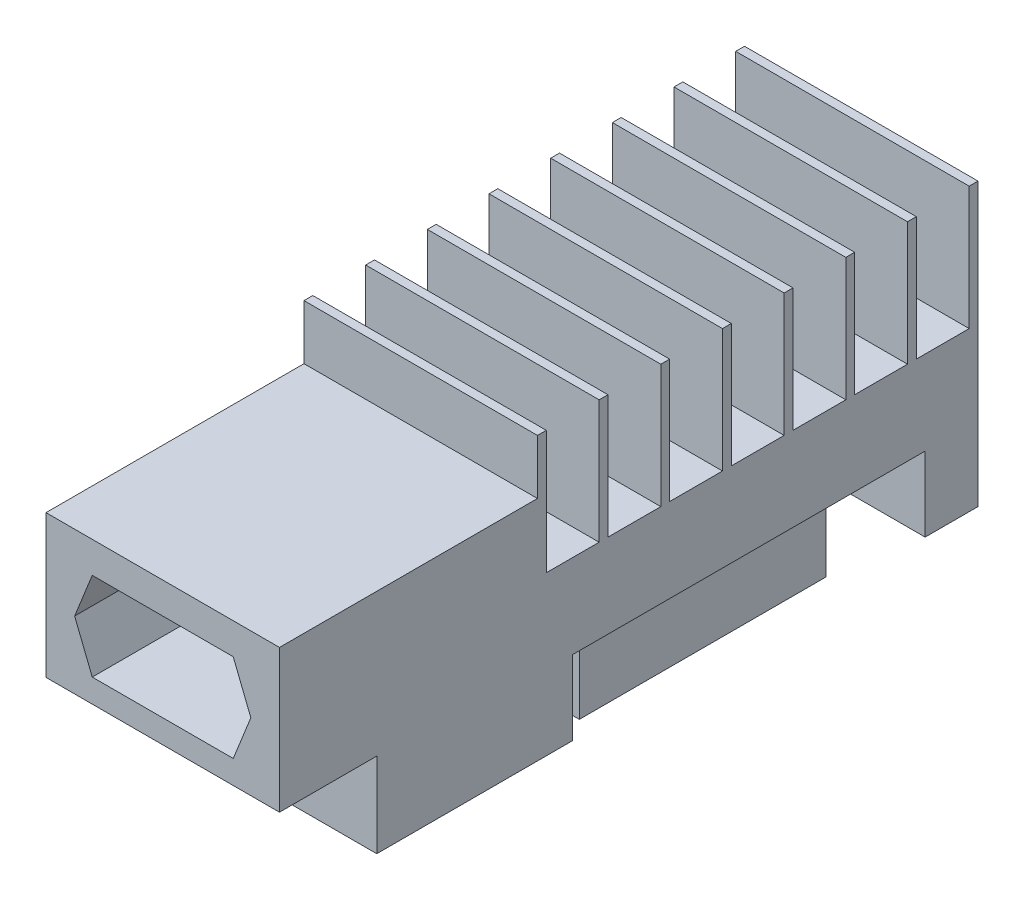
from build123d import *

# Parameters (mm, degrees)
SKETCH2_W           = 13.25
SKETCH2_H           = 39.64
EXTRUDE2_DEPTH      = 16
CUT_EXTRUDE1_REACH  = 46.754
SKETCH3_W           = 3
SKETCH3_H           = 7
LPATTERN1_COUNT     = 7
LPATTERN1_PITCH     = 3.5
CUT_EXTRUDE8_REACH  = 46.754
SKETCH10_W          = 14.64
SKETCH10_H          = 3.1
CUT_EXTRUDE9_REACH  = 46.754
SKETCH11_W          = 5.52
SKETCH11_H          = 4.8
CUT_EXTRUDE10_REACH = 46.754
SKETCH12_W          = 20
SKETCH12_H          = 4.23
CUT_EXTRUDE11_DEPTH = 8
HOLE1_D             = 0.7
HOLE1_DEPTH         = 3
SKETCH18_W          = 12
SKETCH18_H          = 14
EXTRUDE3_DEPTH      = 4


with BuildPart() as part:
    # Sketch2 → Extrude2 (new body)
    with BuildSketch(Plane(origin=(0, 16, 0), x_dir=(-1, 0, 0), z_dir=(0, 1, 0))):
        with Locations((0, 19.82)):
            Rectangle(SKETCH2_W, SKETCH2_H)
    extrude(amount=-EXTRUDE2_DEPTH)

    # Sketch3 → Cut-Extrude1 (cut, up to next)
    with BuildSketch(Plane.ZY.offset(6.625), mode=Mode.PRIVATE) as cut_extrude1_sk1:
        with Locations((2, 12.5)):
            Rectangle(SKETCH3_W, SKETCH3_H)
    cut_extrude1_tool1 = extrude(cut_extrude1_sk1.sketch, amount=-CUT_EXTRUDE1_REACH, mode=Mode.PRIVATE) & part.part
    cut_extrude1 = cut_extrude1_tool1.solids().sort_by_distance((-6.625, 12.5, 2))[0]
    add(cut_extrude1, mode=Mode.SUBTRACT)

    # LPattern1: Cut-Extrude1 ×7
    with Locations(*[(0, 0, i * LPATTERN1_PITCH) for i in range(1, LPATTERN1_COUNT)]):
        add(cut_extrude1, mode=Mode.SUBTRACT)

    # Sketch10 → Cut-Extrude8 (cut, up to next)
    with BuildSketch(Plane.ZY.offset(6.625), mode=Mode.PRIVATE) as cut_extrude8_sk1:
        with Locations((32.32, 14.45)):
            Rectangle(SKETCH10_W, SKETCH10_H)
    cut_extrude8_tool1 = extrude(cut_extrude8_sk1.sketch, amount=-CUT_EXTRUDE8_REACH, mode=Mode.PRIVATE) & part.part
    add(cut_extrude8_tool1.solids().sort_by_distance((-6.625, 14.45, 32.32))[0], mode=Mode.SUBTRACT)

    # Sketch11 → Cut-Extrude9 (cut, up to next)
    with BuildSketch(Plane.ZY.offset(6.625), mode=Mode.PRIVATE) as cut_extrude9_sk1:
        with Locations((36.88, 2.4)):
            Rectangle(SKETCH11_W, SKETCH11_H)
    cut_extrude9_tool1 = extrude(cut_extrude9_sk1.sketch, amount=-CUT_EXTRUDE9_REACH, mode=Mode.PRIVATE) & part.part
    add(cut_extrude9_tool1.solids().sort_by_distance((-6.625, 2.4, 36.88))[0], mode=Mode.SUBTRACT)

    # Sketch12 → Cut-Extrude10 (cut, up to next)
    with BuildSketch(Plane.ZY.offset(6.625), mode=Mode.PRIVATE) as cut_extrude10_sk1:
        with Locations((13, 2.115)):
            Rectangle(SKETCH12_W, SKETCH12_H)
    cut_extrude10_tool1 = extrude(cut_extrude10_sk1.sketch, amount=-CUT_EXTRUDE10_REACH, mode=Mode.PRIVATE) & part.part
    add(cut_extrude10_tool1.solids().sort_by_distance((-6.625, 2.115, 13))[0], mode=Mode.SUBTRACT)

    # Sketch13 → Cut-Extrude11 (cut)
    with BuildSketch(Plane.XY.offset(39.64)):
        Polygon((4, 6.13), (5, 8.63), (4, 11.13), (-4, 11.13), (-5, 8.63), (-4, 6.13), align=None)
    extrude(amount=-CUT_EXTRUDE11_DEPTH, mode=Mode.SUBTRACT)

    # Hole1
    with Locations(Plane.XY.offset(31.64)):
        with Locations((-2.3, 8.63), (2.3, 8.63)):
            Hole(HOLE1_D / 2, depth=HOLE1_DEPTH)


with BuildPart() as body_2:
    # Sketch18 → Extrude3 (new body)
    with BuildSketch(Plane(origin=(0, 4.23, 0), x_dir=(-1, 0, 0), z_dir=(0, 1, 0))):
        with Locations((0, 15)):
            Rectangle(SKETCH18_W, SKETCH18_H)
    extrude(amount=-EXTRUDE3_DEPTH)


solid = Compound([part.part, body_2.part])
